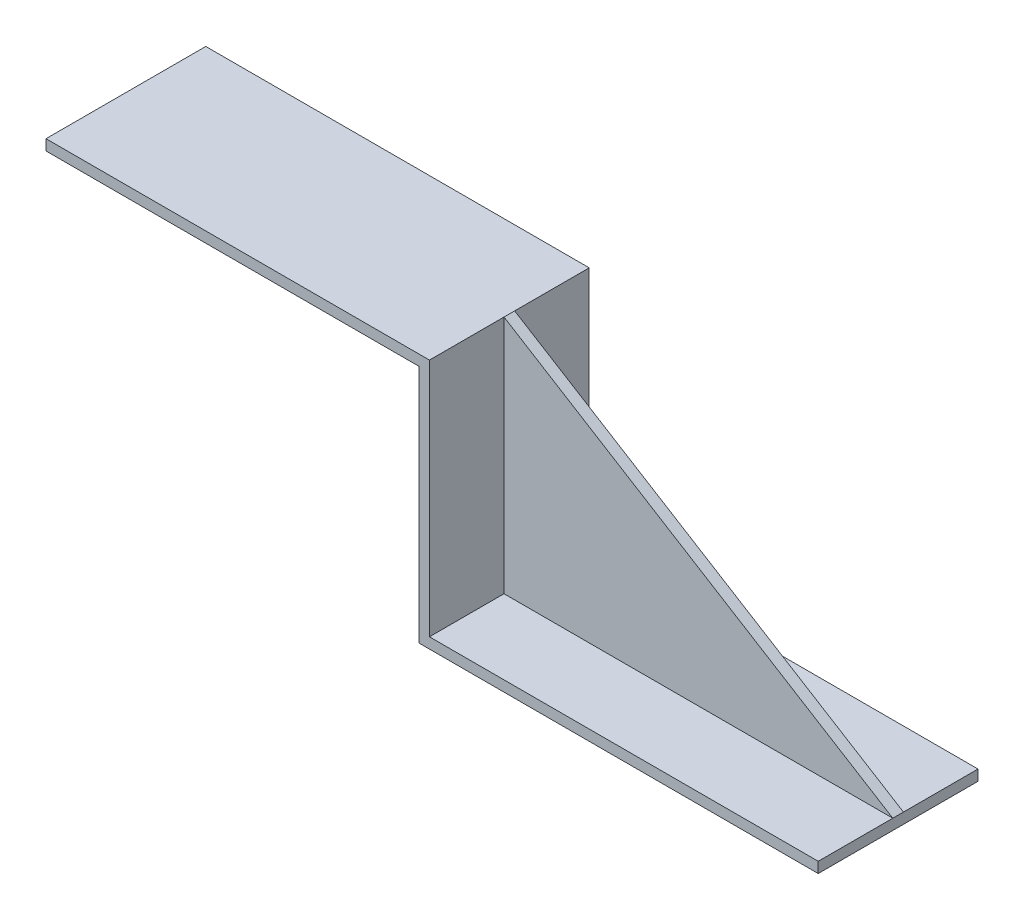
ISO-10303-21;
HEADER;
FILE_DESCRIPTION(('STEP AP214'),'2;1');
FILE_NAME('part.step','',(''),(''),'','','');
FILE_SCHEMA(('AUTOMOTIVE_DESIGN { 1 0 10303 214 1 1 1 1 }'));
ENDSEC;
DATA;
#1=APPLICATION_CONTEXT('core data for automotive mechanical design processes');
#2=APPLICATION_PROTOCOL_DEFINITION('international standard','automotive_design',2000,#1);
#3=PRODUCT_CONTEXT('',#1,'mechanical');
#4=PRODUCT('Part','Part','',(#3));
#5=PRODUCT_RELATED_PRODUCT_CATEGORY('part','',(#4));
#6=PRODUCT_DEFINITION_FORMATION('','',#4);
#7=PRODUCT_DEFINITION_CONTEXT('part definition',#1,'design');
#8=PRODUCT_DEFINITION('design','',#6,#7);
#9=PRODUCT_DEFINITION_SHAPE('','',#8);
#10=(LENGTH_UNIT() NAMED_UNIT(*) SI_UNIT(.MILLI.,.METRE.));
#11=(NAMED_UNIT(*) PLANE_ANGLE_UNIT() SI_UNIT($,.RADIAN.));
#12=(NAMED_UNIT(*) SI_UNIT($,.STERADIAN.) SOLID_ANGLE_UNIT());
#13=UNCERTAINTY_MEASURE_WITH_UNIT(LENGTH_MEASURE(1.E-05),#10,'distance_accuracy_value','');
#14=(GEOMETRIC_REPRESENTATION_CONTEXT(3) GLOBAL_UNCERTAINTY_ASSIGNED_CONTEXT((#13)) GLOBAL_UNIT_ASSIGNED_CONTEXT((#10,
#11,#12)) REPRESENTATION_CONTEXT('',''));
#15=CARTESIAN_POINT('',(0.,0.,0.));
#16=DIRECTION('',(0.,0.,1.));
#17=DIRECTION('',(1.,0.,0.));
#18=AXIS2_PLACEMENT_3D('',#15,#16,#17);
#19=CARTESIAN_POINT('',(0.,2.,15.));
#20=DIRECTION('',(0.,-1.,0.));
#21=DIRECTION('',(1.,0.,0.));
#22=AXIS2_PLACEMENT_3D('',#19,#20,#21);
#23=PLANE('',#22);
#24=DIRECTION('',(-1.,0.,0.));
#25=VECTOR('',#24,1.);
#26=CARTESIAN_POINT('',(0.,2.,-1.));
#27=LINE('',#26,#25);
#28=CARTESIAN_POINT('',(0.,2.,-1.));
#29=VERTEX_POINT('',#28);
#30=CARTESIAN_POINT('',(-73.,1.99999999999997,-1.));
#31=VERTEX_POINT('',#30);
#32=EDGE_CURVE('E47',#29,#31,#27,.T.);
#33=ORIENTED_EDGE('',*,*,#32,.F.);
#34=DIRECTION('',(0.,0.,-1.));
#35=VECTOR('',#34,1.);
#36=CARTESIAN_POINT('',(0.,2.,15.));
#37=LINE('',#36,#35);
#38=CARTESIAN_POINT('',(0.,2.,-15.));
#39=VERTEX_POINT('',#38);
#40=EDGE_CURVE('E194',#29,#39,#37,.T.);
#41=ORIENTED_EDGE('',*,*,#40,.T.);
#42=DIRECTION('',(-1.,0.,0.));
#43=VECTOR('',#42,1.);
#44=CARTESIAN_POINT('',(0.,2.,-15.));
#45=LINE('',#44,#43);
#46=CARTESIAN_POINT('',(-73.,1.99999999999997,-15.));
#47=VERTEX_POINT('',#46);
#48=EDGE_CURVE('E166',#39,#47,#45,.T.);
#49=ORIENTED_EDGE('',*,*,#48,.T.);
#50=DIRECTION('',(0.,0.,-1.));
#51=VECTOR('',#50,1.);
#52=CARTESIAN_POINT('',(-73.,1.99999999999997,15.));
#53=LINE('',#52,#51);
#54=EDGE_CURVE('E190',#31,#47,#53,.T.);
#55=ORIENTED_EDGE('',*,*,#54,.F.);
#56=EDGE_LOOP('',(#33,#41,#49,#55));
#57=FACE_BOUND('',#56,.T.);
#58=ADVANCED_FACE('F32',(#57),#23,.F.);
#59=CARTESIAN_POINT('',(-73.,0.,15.));
#60=DIRECTION('',(-1.,0.,0.));
#61=DIRECTION('',(0.,0.,1.));
#62=AXIS2_PLACEMENT_3D('',#59,#60,#61);
#63=PLANE('',#62);
#64=DIRECTION('',(0.,1.,0.));
#65=VECTOR('',#64,1.);
#66=CARTESIAN_POINT('',(-73.,0.,-1.));
#67=LINE('',#66,#65);
#68=CARTESIAN_POINT('',(-73.,47.,-1.));
#69=VERTEX_POINT('',#68);
#70=EDGE_CURVE('E40',#31,#69,#67,.T.);
#71=ORIENTED_EDGE('',*,*,#70,.F.);
#72=ORIENTED_EDGE('',*,*,#54,.T.);
#73=DIRECTION('',(0.,1.,0.));
#74=VECTOR('',#73,1.);
#75=CARTESIAN_POINT('',(-73.,0.,-15.));
#76=LINE('',#75,#74);
#77=CARTESIAN_POINT('',(-73.,47.,-15.));
#78=VERTEX_POINT('',#77);
#79=EDGE_CURVE('E132',#47,#78,#76,.T.);
#80=ORIENTED_EDGE('',*,*,#79,.T.);
#81=DIRECTION('',(0.,0.,-1.));
#82=VECTOR('',#81,1.);
#83=CARTESIAN_POINT('',(-73.,47.,15.));
#84=LINE('',#83,#82);
#85=EDGE_CURVE('E118',#69,#78,#84,.T.);
#86=ORIENTED_EDGE('',*,*,#85,.F.);
#87=EDGE_LOOP('',(#71,#72,#80,#86));
#88=FACE_BOUND('',#87,.T.);
#89=ADVANCED_FACE('F130',(#88),#63,.F.);
#90=CARTESIAN_POINT('',(-75.,47.,15.));
#91=DIRECTION('',(0.,-1.,0.));
#92=DIRECTION('',(0.,0.,-1.));
#93=AXIS2_PLACEMENT_3D('',#90,#91,#92);
#94=PLANE('',#93);
#95=CARTESIAN_POINT('',(-73.,47.,15.));
#96=VERTEX_POINT('',#95);
#97=CARTESIAN_POINT('',(-73.,47.,1.));
#98=VERTEX_POINT('',#97);
#99=EDGE_CURVE('E122',#96,#98,#84,.T.);
#100=ORIENTED_EDGE('',*,*,#99,.T.);
#101=EDGE_CURVE('E115',#98,#69,#84,.T.);
#102=ORIENTED_EDGE('',*,*,#101,.T.);
#103=ORIENTED_EDGE('',*,*,#85,.T.);
#104=DIRECTION('',(1.,0.,0.));
#105=VECTOR('',#104,1.);
#106=CARTESIAN_POINT('',(-75.,47.,-15.));
#107=LINE('',#106,#105);
#108=CARTESIAN_POINT('',(-145.,47.,-15.));
#109=VERTEX_POINT('',#108);
#110=EDGE_CURVE('E149',#78,#109,#107,.F.);
#111=ORIENTED_EDGE('',*,*,#110,.T.);
#112=DIRECTION('',(0.,0.,-1.));
#113=VECTOR('',#112,1.);
#114=CARTESIAN_POINT('',(-145.,47.,15.));
#115=LINE('',#114,#113);
#116=CARTESIAN_POINT('',(-145.,47.,15.));
#117=VERTEX_POINT('',#116);
#118=EDGE_CURVE('E139',#117,#109,#115,.T.);
#119=ORIENTED_EDGE('',*,*,#118,.F.);
#120=DIRECTION('',(1.,0.,0.));
#121=VECTOR('',#120,1.);
#122=CARTESIAN_POINT('',(-75.,47.,15.));
#123=LINE('',#122,#121);
#124=EDGE_CURVE('E170',#96,#117,#123,.F.);
#125=ORIENTED_EDGE('',*,*,#124,.F.);
#126=EDGE_LOOP('',(#100,#102,#103,#111,#119,#125));
#127=FACE_BOUND('',#126,.T.);
#128=ADVANCED_FACE('F34',(#127),#94,.F.);
#129=CARTESIAN_POINT('',(-145.,45.,15.));
#130=DIRECTION('',(-1.,0.,0.));
#131=DIRECTION('',(0.,0.,1.));
#132=AXIS2_PLACEMENT_3D('',#129,#130,#131);
#133=PLANE('',#132);
#134=ORIENTED_EDGE('',*,*,#118,.T.);
#135=DIRECTION('',(0.,1.,0.));
#136=VECTOR('',#135,1.);
#137=CARTESIAN_POINT('',(-145.,45.,-15.));
#138=LINE('',#137,#136);
#139=CARTESIAN_POINT('',(-145.,45.,-15.));
#140=VERTEX_POINT('',#139);
#141=EDGE_CURVE('E151',#140,#109,#138,.T.);
#142=ORIENTED_EDGE('',*,*,#141,.F.);
#143=DIRECTION('',(0.,0.,-1.));
#144=VECTOR('',#143,1.);
#145=CARTESIAN_POINT('',(-145.,45.,15.));
#146=LINE('',#145,#144);
#147=CARTESIAN_POINT('',(-145.,45.,15.));
#148=VERTEX_POINT('',#147);
#149=EDGE_CURVE('E203',#148,#140,#146,.T.);
#150=ORIENTED_EDGE('',*,*,#149,.F.);
#151=DIRECTION('',(0.,1.,0.));
#152=VECTOR('',#151,1.);
#153=CARTESIAN_POINT('',(-145.,45.,15.));
#154=LINE('',#153,#152);
#155=EDGE_CURVE('E172',#148,#117,#154,.T.);
#156=ORIENTED_EDGE('',*,*,#155,.T.);
#157=EDGE_LOOP('',(#134,#142,#150,#156));
#158=FACE_BOUND('',#157,.T.);
#159=ADVANCED_FACE('F208',(#158),#133,.T.);
#160=CARTESIAN_POINT('',(-75.,45.,15.));
#161=DIRECTION('',(0.,-1.,0.));
#162=DIRECTION('',(0.,0.,-1.));
#163=AXIS2_PLACEMENT_3D('',#160,#161,#162);
#164=PLANE('',#163);
#165=ORIENTED_EDGE('',*,*,#149,.T.);
#166=DIRECTION('',(-1.,0.,0.));
#167=VECTOR('',#166,1.);
#168=CARTESIAN_POINT('',(-75.,45.,-15.));
#169=LINE('',#168,#167);
#170=CARTESIAN_POINT('',(-75.,45.,-15.));
#171=VERTEX_POINT('',#170);
#172=EDGE_CURVE('E154',#171,#140,#169,.T.);
#173=ORIENTED_EDGE('',*,*,#172,.F.);
#174=DIRECTION('',(0.,0.,-1.));
#175=VECTOR('',#174,1.);
#176=CARTESIAN_POINT('',(-75.,45.,15.));
#177=LINE('',#176,#175);
#178=CARTESIAN_POINT('',(-75.,45.,15.));
#179=VERTEX_POINT('',#178);
#180=EDGE_CURVE('E201',#179,#171,#177,.T.);
#181=ORIENTED_EDGE('',*,*,#180,.F.);
#182=DIRECTION('',(-1.,0.,0.));
#183=VECTOR('',#182,1.);
#184=CARTESIAN_POINT('',(-75.,45.,15.));
#185=LINE('',#184,#183);
#186=EDGE_CURVE('E175',#179,#148,#185,.T.);
#187=ORIENTED_EDGE('',*,*,#186,.T.);
#188=EDGE_LOOP('',(#165,#173,#181,#187));
#189=FACE_BOUND('',#188,.T.);
#190=ADVANCED_FACE('F215',(#189),#164,.T.);
#191=CARTESIAN_POINT('',(-75.,0.,15.));
#192=DIRECTION('',(-1.,0.,0.));
#193=DIRECTION('',(0.,0.,1.));
#194=AXIS2_PLACEMENT_3D('',#191,#192,#193);
#195=PLANE('',#194);
#196=ORIENTED_EDGE('',*,*,#180,.T.);
#197=DIRECTION('',(0.,1.,0.));
#198=VECTOR('',#197,1.);
#199=CARTESIAN_POINT('',(-75.,0.,-15.));
#200=LINE('',#199,#198);
#201=CARTESIAN_POINT('',(-75.,0.,-15.));
#202=VERTEX_POINT('',#201);
#203=EDGE_CURVE('E157',#202,#171,#200,.T.);
#204=ORIENTED_EDGE('',*,*,#203,.F.);
#205=DIRECTION('',(0.,0.,-1.));
#206=VECTOR('',#205,1.);
#207=CARTESIAN_POINT('',(-75.,0.,15.));
#208=LINE('',#207,#206);
#209=CARTESIAN_POINT('',(-75.,0.,15.));
#210=VERTEX_POINT('',#209);
#211=EDGE_CURVE('E199',#210,#202,#208,.T.);
#212=ORIENTED_EDGE('',*,*,#211,.F.);
#213=DIRECTION('',(0.,1.,0.));
#214=VECTOR('',#213,1.);
#215=CARTESIAN_POINT('',(-75.,0.,15.));
#216=LINE('',#215,#214);
#217=EDGE_CURVE('E178',#210,#179,#216,.T.);
#218=ORIENTED_EDGE('',*,*,#217,.T.);
#219=EDGE_LOOP('',(#196,#204,#212,#218));
#220=FACE_BOUND('',#219,.T.);
#221=ADVANCED_FACE('F254',(#220),#195,.T.);
#222=CARTESIAN_POINT('',(0.,0.,15.));
#223=DIRECTION('',(0.,-1.,0.));
#224=DIRECTION('',(1.,0.,0.));
#225=AXIS2_PLACEMENT_3D('',#222,#223,#224);
#226=PLANE('',#225);
#227=ORIENTED_EDGE('',*,*,#211,.T.);
#228=DIRECTION('',(-1.,0.,0.));
#229=VECTOR('',#228,1.);
#230=CARTESIAN_POINT('',(0.,0.,-15.));
#231=LINE('',#230,#229);
#232=CARTESIAN_POINT('',(0.,0.,-15.));
#233=VERTEX_POINT('',#232);
#234=EDGE_CURVE('E160',#233,#202,#231,.T.);
#235=ORIENTED_EDGE('',*,*,#234,.F.);
#236=DIRECTION('',(0.,0.,-1.));
#237=VECTOR('',#236,1.);
#238=CARTESIAN_POINT('',(0.,0.,15.));
#239=LINE('',#238,#237);
#240=CARTESIAN_POINT('',(0.,0.,15.));
#241=VERTEX_POINT('',#240);
#242=EDGE_CURVE('E197',#241,#233,#239,.T.);
#243=ORIENTED_EDGE('',*,*,#242,.F.);
#244=DIRECTION('',(-1.,0.,0.));
#245=VECTOR('',#244,1.);
#246=CARTESIAN_POINT('',(0.,0.,15.));
#247=LINE('',#246,#245);
#248=EDGE_CURVE('E181',#241,#210,#247,.T.);
#249=ORIENTED_EDGE('',*,*,#248,.T.);
#250=EDGE_LOOP('',(#227,#235,#243,#249));
#251=FACE_BOUND('',#250,.T.);
#252=ADVANCED_FACE('F237',(#251),#226,.T.);
#253=CARTESIAN_POINT('',(0.,2.,15.));
#254=DIRECTION('',(1.,0.,0.));
#255=DIRECTION('',(0.,1.,0.));
#256=AXIS2_PLACEMENT_3D('',#253,#254,#255);
#257=PLANE('',#256);
#258=ORIENTED_EDGE('',*,*,#242,.T.);
#259=DIRECTION('',(0.,-1.,0.));
#260=VECTOR('',#259,1.);
#261=CARTESIAN_POINT('',(0.,2.,-15.));
#262=LINE('',#261,#260);
#263=EDGE_CURVE('E163',#39,#233,#262,.T.);
#264=ORIENTED_EDGE('',*,*,#263,.F.);
#265=ORIENTED_EDGE('',*,*,#40,.F.);
#266=DIRECTION('',(0.,0.,-1.));
#267=VECTOR('',#266,1.);
#268=CARTESIAN_POINT('',(0.,2.,15.));
#269=LINE('',#268,#267);
#270=CARTESIAN_POINT('',(0.,2.,1.));
#271=VERTEX_POINT('',#270);
#272=EDGE_CURVE('E54',#29,#271,#269,.F.);
#273=ORIENTED_EDGE('',*,*,#272,.T.);
#274=CARTESIAN_POINT('',(0.,2.,15.));
#275=VERTEX_POINT('',#274);
#276=EDGE_CURVE('E195',#275,#271,#37,.T.);
#277=ORIENTED_EDGE('',*,*,#276,.F.);
#278=DIRECTION('',(0.,-1.,0.));
#279=VECTOR('',#278,1.);
#280=CARTESIAN_POINT('',(0.,2.,15.));
#281=LINE('',#280,#279);
#282=EDGE_CURVE('E184',#275,#241,#281,.T.);
#283=ORIENTED_EDGE('',*,*,#282,.T.);
#284=EDGE_LOOP('',(#258,#264,#265,#273,#277,#283));
#285=FACE_BOUND('',#284,.T.);
#286=ADVANCED_FACE('F232',(#285),#257,.T.);
#287=ORIENTED_EDGE('',*,*,#276,.T.);
#288=DIRECTION('',(-1.,0.,0.));
#289=VECTOR('',#288,1.);
#290=CARTESIAN_POINT('',(0.,2.,1.));
#291=LINE('',#290,#289);
#292=CARTESIAN_POINT('',(-73.,1.99999999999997,1.));
#293=VERTEX_POINT('',#292);
#294=EDGE_CURVE('E146',#271,#293,#291,.T.);
#295=ORIENTED_EDGE('',*,*,#294,.T.);
#296=CARTESIAN_POINT('',(-73.,1.99999999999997,15.));
#297=VERTEX_POINT('',#296);
#298=EDGE_CURVE('E191',#297,#293,#53,.T.);
#299=ORIENTED_EDGE('',*,*,#298,.F.);
#300=DIRECTION('',(-1.,0.,0.));
#301=VECTOR('',#300,1.);
#302=CARTESIAN_POINT('',(0.,2.,15.));
#303=LINE('',#302,#301);
#304=EDGE_CURVE('E187',#275,#297,#303,.T.);
#305=ORIENTED_EDGE('',*,*,#304,.F.);
#306=EDGE_LOOP('',(#287,#295,#299,#305));
#307=FACE_BOUND('',#306,.T.);
#308=ADVANCED_FACE('F231',(#307),#23,.F.);
#309=ORIENTED_EDGE('',*,*,#298,.T.);
#310=DIRECTION('',(0.,1.,0.));
#311=VECTOR('',#310,1.);
#312=CARTESIAN_POINT('',(-73.,0.,1.));
#313=LINE('',#312,#311);
#314=EDGE_CURVE('E11',#293,#98,#313,.T.);
#315=ORIENTED_EDGE('',*,*,#314,.T.);
#316=ORIENTED_EDGE('',*,*,#99,.F.);
#317=DIRECTION('',(0.,1.,0.));
#318=VECTOR('',#317,1.);
#319=CARTESIAN_POINT('',(-73.,0.,15.));
#320=LINE('',#319,#318);
#321=EDGE_CURVE('E134',#297,#96,#320,.T.);
#322=ORIENTED_EDGE('',*,*,#321,.F.);
#323=EDGE_LOOP('',(#309,#315,#316,#322));
#324=FACE_BOUND('',#323,.T.);
#325=ADVANCED_FACE('F225',(#324),#63,.F.);
#326=CARTESIAN_POINT('',(-145.,47.,15.));
#327=DIRECTION('',(0.,0.,1.));
#328=DIRECTION('',(1.,0.,0.));
#329=AXIS2_PLACEMENT_3D('',#326,#327,#328);
#330=PLANE('',#329);
#331=ORIENTED_EDGE('',*,*,#124,.T.);
#332=ORIENTED_EDGE('',*,*,#155,.F.);
#333=ORIENTED_EDGE('',*,*,#186,.F.);
#334=ORIENTED_EDGE('',*,*,#217,.F.);
#335=ORIENTED_EDGE('',*,*,#248,.F.);
#336=ORIENTED_EDGE('',*,*,#282,.F.);
#337=ORIENTED_EDGE('',*,*,#304,.T.);
#338=ORIENTED_EDGE('',*,*,#321,.T.);
#339=EDGE_LOOP('',(#331,#332,#333,#334,#335,#336,#337,#338));
#340=FACE_BOUND('',#339,.T.);
#341=ADVANCED_FACE('F218',(#340),#330,.T.);
#342=CARTESIAN_POINT('',(-145.,47.,-15.));
#343=DIRECTION('',(0.,0.,1.));
#344=DIRECTION('',(1.,0.,0.));
#345=AXIS2_PLACEMENT_3D('',#342,#343,#344);
#346=PLANE('',#345);
#347=ORIENTED_EDGE('',*,*,#110,.F.);
#348=ORIENTED_EDGE('',*,*,#79,.F.);
#349=ORIENTED_EDGE('',*,*,#48,.F.);
#350=ORIENTED_EDGE('',*,*,#263,.T.);
#351=ORIENTED_EDGE('',*,*,#234,.T.);
#352=ORIENTED_EDGE('',*,*,#203,.T.);
#353=ORIENTED_EDGE('',*,*,#172,.T.);
#354=ORIENTED_EDGE('',*,*,#141,.T.);
#355=EDGE_LOOP('',(#347,#348,#349,#350,#351,#352,#353,#354));
#356=FACE_BOUND('',#355,.T.);
#357=ADVANCED_FACE('F211',(#356),#346,.F.);
#358=CARTESIAN_POINT('',(-73.,47.,0.));
#359=DIRECTION('',(-0.524747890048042,-0.851257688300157,0.));
#360=DIRECTION('',(0.851257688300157,-0.524747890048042,0.));
#361=AXIS2_PLACEMENT_3D('',#358,#359,#360);
#362=PLANE('',#361);
#363=ORIENTED_EDGE('',*,*,#272,.F.);
#364=DIRECTION('',(0.851257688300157,-0.524747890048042,0.));
#365=VECTOR('',#364,1.);
#366=CARTESIAN_POINT('',(-73.,47.,-1.));
#367=LINE('',#366,#365);
#368=EDGE_CURVE('E138',#69,#29,#367,.T.);
#369=ORIENTED_EDGE('',*,*,#368,.F.);
#370=ORIENTED_EDGE('',*,*,#101,.F.);
#371=DIRECTION('',(0.851257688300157,-0.524747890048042,0.));
#372=VECTOR('',#371,1.);
#373=CARTESIAN_POINT('',(-73.,47.,1.));
#374=LINE('',#373,#372);
#375=EDGE_CURVE('E141',#98,#271,#374,.T.);
#376=ORIENTED_EDGE('',*,*,#375,.T.);
#377=EDGE_LOOP('',(#363,#369,#370,#376));
#378=FACE_BOUND('',#377,.T.);
#379=ADVANCED_FACE('F140',(#378),#362,.F.);
#380=CARTESIAN_POINT('',(-72.5,23.5,1.));
#381=DIRECTION('',(0.,0.,1.));
#382=DIRECTION('',(1.,0.,0.));
#383=AXIS2_PLACEMENT_3D('',#380,#381,#382);
#384=PLANE('',#383);
#385=ORIENTED_EDGE('',*,*,#294,.F.);
#386=ORIENTED_EDGE('',*,*,#375,.F.);
#387=ORIENTED_EDGE('',*,*,#314,.F.);
#388=EDGE_LOOP('',(#385,#386,#387));
#389=FACE_BOUND('',#388,.T.);
#390=ADVANCED_FACE('F229',(#389),#384,.T.);
#391=CARTESIAN_POINT('',(-72.5,23.5,-1.));
#392=DIRECTION('',(0.,0.,1.));
#393=DIRECTION('',(1.,0.,0.));
#394=AXIS2_PLACEMENT_3D('',#391,#392,#393);
#395=PLANE('',#394);
#396=ORIENTED_EDGE('',*,*,#368,.T.);
#397=ORIENTED_EDGE('',*,*,#32,.T.);
#398=ORIENTED_EDGE('',*,*,#70,.T.);
#399=EDGE_LOOP('',(#396,#397,#398));
#400=FACE_BOUND('',#399,.T.);
#401=ADVANCED_FACE('F137',(#400),#395,.F.);
#402=CLOSED_SHELL('',(#58,#89,#128,#159,#190,#221,#252,#286,#308,#325,#341,#357,#379,#390,#401));
#403=MANIFOLD_SOLID_BREP('B2',#402);
#404=ADVANCED_BREP_SHAPE_REPRESENTATION('',(#18,#403),#14);
#405=SHAPE_DEFINITION_REPRESENTATION(#9,#404);
ENDSEC;
END-ISO-10303-21;
